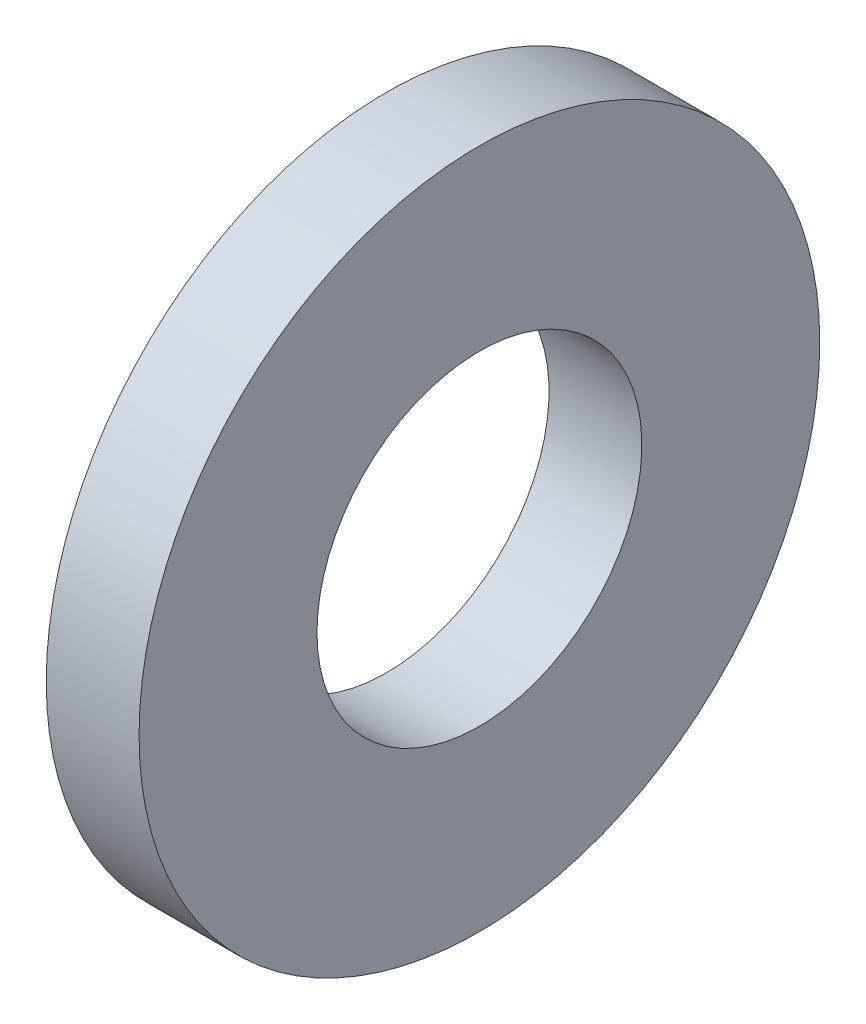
from build123d import *

# Parameters (mm, degrees)
ESQUISSE1_W = 3
ESQUISSE1_H = 5.75


with BuildPart() as part:
    # Esquisse1 → Base-R_volution (revolve)
    with BuildSketch(Plane(origin=(0, 0, 0), x_dir=(1, 0, 0), z_dir=(0, 1, 0)), mode=Mode.PRIVATE) as base_r_volution_sk:
        with Locations((1.5, 8.125)):
            Rectangle(ESQUISSE1_W, ESQUISSE1_H)
    revolve(base_r_volution_sk.sketch.rotate(Axis((0, 0, 0), (1, 0, 0)), 180), axis=Axis((0, 0, 0), (1, 0, 0)))


solid = part.part
